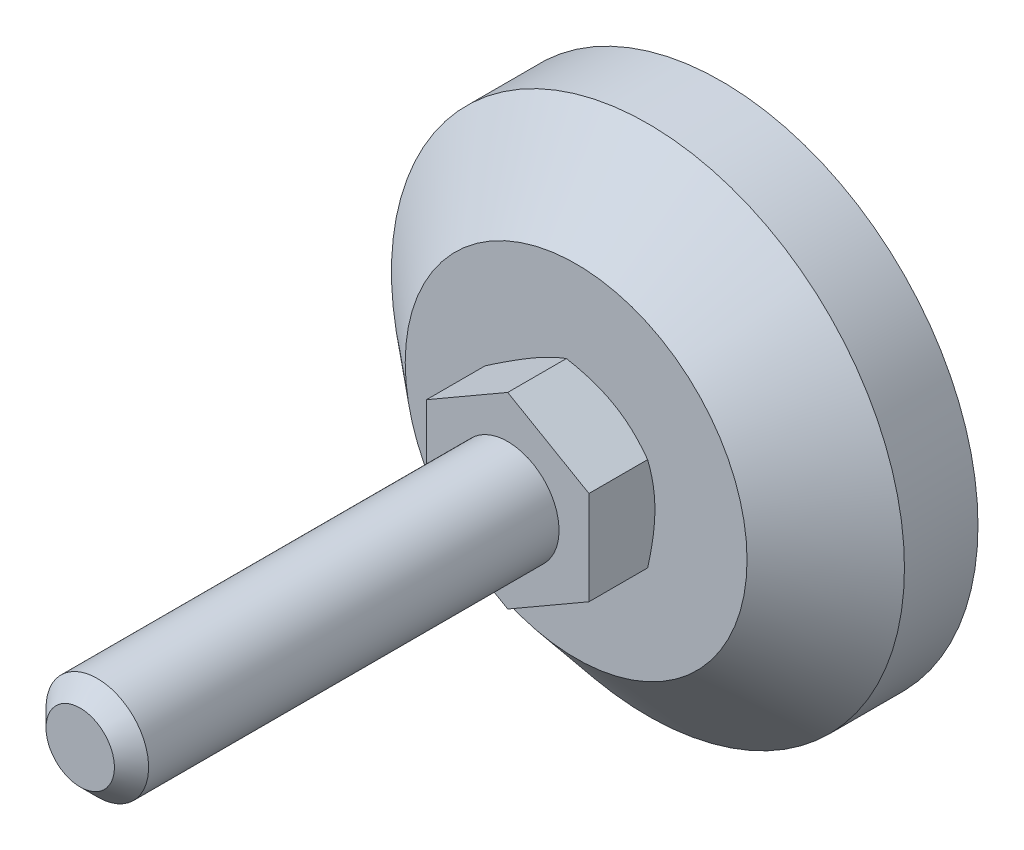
ISO-10303-21;
HEADER;
FILE_DESCRIPTION(('STEP AP214'),'2;1');
FILE_NAME('part.step','',(''),(''),'','','');
FILE_SCHEMA(('AUTOMOTIVE_DESIGN { 1 0 10303 214 1 1 1 1 }'));
ENDSEC;
DATA;
#1=APPLICATION_CONTEXT('core data for automotive mechanical design processes');
#2=APPLICATION_PROTOCOL_DEFINITION('international standard','automotive_design',2000,#1);
#3=PRODUCT_CONTEXT('',#1,'mechanical');
#4=PRODUCT('Part','Part','',(#3));
#5=PRODUCT_RELATED_PRODUCT_CATEGORY('part','',(#4));
#6=PRODUCT_DEFINITION_FORMATION('','',#4);
#7=PRODUCT_DEFINITION_CONTEXT('part definition',#1,'design');
#8=PRODUCT_DEFINITION('design','',#6,#7);
#9=PRODUCT_DEFINITION_SHAPE('','',#8);
#10=(LENGTH_UNIT() NAMED_UNIT(*) SI_UNIT(.MILLI.,.METRE.));
#11=(NAMED_UNIT(*) PLANE_ANGLE_UNIT() SI_UNIT($,.RADIAN.));
#12=(NAMED_UNIT(*) SI_UNIT($,.STERADIAN.) SOLID_ANGLE_UNIT());
#13=UNCERTAINTY_MEASURE_WITH_UNIT(LENGTH_MEASURE(1.E-05),#10,'distance_accuracy_value','');
#14=(GEOMETRIC_REPRESENTATION_CONTEXT(3) GLOBAL_UNCERTAINTY_ASSIGNED_CONTEXT((#13)) GLOBAL_UNIT_ASSIGNED_CONTEXT((#10,
#11,#12)) REPRESENTATION_CONTEXT('',''));
#15=CARTESIAN_POINT('',(0.,0.,0.));
#16=DIRECTION('',(0.,0.,1.));
#17=DIRECTION('',(1.,0.,0.));
#18=AXIS2_PLACEMENT_3D('',#15,#16,#17);
#19=CARTESIAN_POINT('',(0.,0.,25.));
#20=DIRECTION('',(0.,0.,1.));
#21=DIRECTION('',(0.5,-0.866025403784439,0.));
#22=AXIS2_PLACEMENT_3D('',#19,#20,#21);
#23=PLANE('',#22);
#24=DIRECTION('',(0.,1.,0.));
#25=VECTOR('',#24,1.);
#26=CARTESIAN_POINT('',(9.5,-5.48482755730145,25.));
#27=LINE('',#26,#25);
#28=CARTESIAN_POINT('',(9.5,-5.48482755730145,25.));
#29=VERTEX_POINT('',#28);
#30=CARTESIAN_POINT('',(9.5,5.48482755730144,25.));
#31=VERTEX_POINT('',#30);
#32=EDGE_CURVE('E197',#29,#31,#27,.T.);
#33=ORIENTED_EDGE('',*,*,#32,.T.);
#34=DIRECTION('',(-0.866025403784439,0.5,0.));
#35=VECTOR('',#34,1.);
#36=CARTESIAN_POINT('',(9.5,5.48482755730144,25.));
#37=LINE('',#36,#35);
#38=CARTESIAN_POINT('',(0.,10.9696551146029,25.));
#39=VERTEX_POINT('',#38);
#40=EDGE_CURVE('E320',#31,#39,#37,.T.);
#41=ORIENTED_EDGE('',*,*,#40,.T.);
#42=DIRECTION('',(-0.866025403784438,-0.5,0.));
#43=VECTOR('',#42,1.);
#44=CARTESIAN_POINT('',(0.,10.9696551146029,25.));
#45=LINE('',#44,#43);
#46=CARTESIAN_POINT('',(-9.5,5.48482755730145,25.));
#47=VERTEX_POINT('',#46);
#48=EDGE_CURVE('E319',#39,#47,#45,.T.);
#49=ORIENTED_EDGE('',*,*,#48,.T.);
#50=DIRECTION('',(0.,-1.,0.));
#51=VECTOR('',#50,1.);
#52=CARTESIAN_POINT('',(-9.5,5.48482755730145,25.));
#53=LINE('',#52,#51);
#54=CARTESIAN_POINT('',(-9.5,-5.48482755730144,25.));
#55=VERTEX_POINT('',#54);
#56=EDGE_CURVE('E324',#47,#55,#53,.T.);
#57=ORIENTED_EDGE('',*,*,#56,.T.);
#58=DIRECTION('',(0.866025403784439,-0.5,0.));
#59=VECTOR('',#58,1.);
#60=CARTESIAN_POINT('',(-9.5,-5.48482755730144,25.));
#61=LINE('',#60,#59);
#62=CARTESIAN_POINT('',(0.,-10.9696551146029,25.));
#63=VERTEX_POINT('',#62);
#64=EDGE_CURVE('E326',#55,#63,#61,.T.);
#65=ORIENTED_EDGE('',*,*,#64,.T.);
#66=DIRECTION('',(0.866025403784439,0.5,0.));
#67=VECTOR('',#66,1.);
#68=CARTESIAN_POINT('',(0.,-10.9696551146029,25.));
#69=LINE('',#68,#67);
#70=EDGE_CURVE('E37',#63,#29,#69,.T.);
#71=ORIENTED_EDGE('',*,*,#70,.T.);
#72=EDGE_LOOP('',(#33,#41,#49,#57,#65,#71));
#73=FACE_BOUND('',#72,.T.);
#74=CARTESIAN_POINT('',(0.,0.,25.));
#75=DIRECTION('',(0.,0.,1.));
#76=DIRECTION('',(0.5,-0.866025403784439,0.));
#77=AXIS2_PLACEMENT_3D('',#74,#75,#76);
#78=CIRCLE('',#77,6.);
#79=CARTESIAN_POINT('',(3.,-5.19615242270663,25.));
#80=VERTEX_POINT('',#79);
#81=EDGE_CURVE('E201',#80,#80,#78,.T.);
#82=ORIENTED_EDGE('',*,*,#81,.F.);
#83=EDGE_LOOP('',(#82));
#84=FACE_BOUND('',#83,.T.);
#85=ADVANCED_FACE('F14',(#73,#84),#23,.T.);
#86=CARTESIAN_POINT('',(-9.99463491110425,17.3112154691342,17.));
#87=DIRECTION('',(0.,0.,1.));
#88=DIRECTION('',(0.5,-0.866025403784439,0.));
#89=AXIS2_PLACEMENT_3D('',#86,#87,#88);
#90=PLANE('',#89);
#91=CARTESIAN_POINT('',(0.,0.,17.));
#92=DIRECTION('',(0.,0.,-1.));
#93=DIRECTION('',(-0.5,0.866025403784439,0.));
#94=AXIS2_PLACEMENT_3D('',#91,#92,#93);
#95=CIRCLE('',#94,19.9892698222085);
#96=CARTESIAN_POINT('',(-9.99463491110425,17.3112154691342,17.));
#97=VERTEX_POINT('',#96);
#98=EDGE_CURVE('E102',#97,#97,#95,.T.);
#99=ORIENTED_EDGE('',*,*,#98,.F.);
#100=EDGE_LOOP('',(#99));
#101=FACE_BOUND('',#100,.T.);
#102=CARTESIAN_POINT('',(0.,0.,17.));
#103=DIRECTION('',(0.,0.,-1.));
#104=DIRECTION('',(-0.5,0.866025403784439,0.));
#105=AXIS2_PLACEMENT_3D('',#102,#103,#104);
#106=CIRCLE('',#105,9.);
#107=CARTESIAN_POINT('',(-4.5,7.79422863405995,17.));
#108=VERTEX_POINT('',#107);
#109=EDGE_CURVE('E84',#108,#108,#106,.T.);
#110=ORIENTED_EDGE('',*,*,#109,.T.);
#111=EDGE_LOOP('',(#110));
#112=FACE_BOUND('',#111,.T.);
#113=ADVANCED_FACE('F174',(#101,#112),#90,.T.);
#114=CARTESIAN_POINT('',(0.,0.,0.));
#115=DIRECTION('',(0.,0.,-1.));
#116=DIRECTION('',(-0.5,0.866025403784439,0.));
#117=AXIS2_PLACEMENT_3D('',#114,#115,#116);
#118=PLANE('',#117);
#119=CARTESIAN_POINT('',(0.,0.,0.));
#120=DIRECTION('',(0.,0.,-1.));
#121=DIRECTION('',(-0.5,0.866025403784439,0.));
#122=AXIS2_PLACEMENT_3D('',#119,#120,#121);
#123=CIRCLE('',#122,30.);
#124=CARTESIAN_POINT('',(-15.,25.9807621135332,0.));
#125=VERTEX_POINT('',#124);
#126=EDGE_CURVE('E73',#125,#125,#123,.T.);
#127=ORIENTED_EDGE('',*,*,#126,.T.);
#128=EDGE_LOOP('',(#127));
#129=FACE_BOUND('',#128,.T.);
#130=ADVANCED_FACE('F177',(#129),#118,.T.);
#131=CARTESIAN_POINT('',(0.,0.,-75.4972525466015));
#132=DIRECTION('',(0.,0.,-1.));
#133=DIRECTION('',(-0.5,0.866025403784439,0.));
#134=AXIS2_PLACEMENT_3D('',#131,#132,#133);
#135=CYLINDRICAL_SURFACE('',#134,30.);
#136=CARTESIAN_POINT('',(0.,0.,8.6));
#137=DIRECTION('',(0.,0.,-1.));
#138=DIRECTION('',(-0.5,0.866025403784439,0.));
#139=AXIS2_PLACEMENT_3D('',#136,#137,#138);
#140=CIRCLE('',#139,30.);
#141=CARTESIAN_POINT('',(-15.,25.9807621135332,8.6));
#142=VERTEX_POINT('',#141);
#143=EDGE_CURVE('E105',#142,#142,#140,.T.);
#144=ORIENTED_EDGE('',*,*,#143,.T.);
#145=EDGE_LOOP('',(#144));
#146=FACE_BOUND('',#145,.T.);
#147=ORIENTED_EDGE('',*,*,#126,.F.);
#148=EDGE_LOOP('',(#147));
#149=FACE_BOUND('',#148,.T.);
#150=ADVANCED_FACE('F181',(#146,#149),#135,.T.);
#151=CARTESIAN_POINT('',(0.,0.,8.6));
#152=DIRECTION('',(0.,0.,-1.));
#153=DIRECTION('',(-0.5,0.866025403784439,0.));
#154=AXIS2_PLACEMENT_3D('',#151,#152,#153);
#155=CONICAL_SURFACE('',#154,30.,0.872664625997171);
#156=ORIENTED_EDGE('',*,*,#98,.T.);
#157=EDGE_LOOP('',(#156));
#158=FACE_BOUND('',#157,.T.);
#159=ORIENTED_EDGE('',*,*,#143,.F.);
#160=EDGE_LOOP('',(#159));
#161=FACE_BOUND('',#160,.T.);
#162=ADVANCED_FACE('F121',(#158,#161),#155,.T.);
#163=CARTESIAN_POINT('',(0.,0.,20.2070856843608));
#164=DIRECTION('',(0.,0.,1.));
#165=DIRECTION('',(0.5,-0.866025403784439,0.));
#166=AXIS2_PLACEMENT_3D('',#163,#164,#165);
#167=CONICAL_SURFACE('',#166,14.5548353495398,1.0471975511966);
#168=ORIENTED_EDGE('',*,*,#109,.F.);
#169=EDGE_LOOP('',(#168));
#170=FACE_BOUND('',#169,.T.);
#171=CARTESIAN_POINT('',(-8.0629212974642,-15.6247848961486,21.955113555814));
#172=CARTESIAN_POINT('',(-7.88302842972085,-15.5209237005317,21.8541996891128));
#173=CARTESIAN_POINT('',(-7.70292590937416,-15.4169414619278,21.7537843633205));
#174=CARTESIAN_POINT('',(-7.34225784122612,-15.2087096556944,21.5540635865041));
#175=CARTESIAN_POINT('',(-7.16169228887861,-15.1044600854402,21.4547581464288));
#176=CARTESIAN_POINT('',(-6.61918813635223,-14.7912451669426,21.158650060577));
#177=CARTESIAN_POINT('',(-6.25649443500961,-14.5818438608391,20.9636851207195));
#178=CARTESIAN_POINT('',(-5.52674967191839,-14.1605255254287,20.5787866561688));
#179=CARTESIAN_POINT('',(-5.15968567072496,-13.9486010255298,20.3888857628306));
#180=CARTESIAN_POINT('',(-4.42265753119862,-13.5230776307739,20.016769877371));
#181=CARTESIAN_POINT('',(-4.05269352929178,-13.3094788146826,19.834554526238));
#182=CARTESIAN_POINT('',(-3.29714002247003,-12.8732597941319,19.4740509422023));
#183=CARTESIAN_POINT('',(-2.911434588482,-12.650572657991,19.2960849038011));
#184=CARTESIAN_POINT('',(-2.1355321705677,-12.2026051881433,18.953471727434));
#185=CARTESIAN_POINT('',(-1.74533469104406,-11.9773245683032,18.7888260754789));
#186=CARTESIAN_POINT('',(-0.960535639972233,-11.5242206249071,18.4771310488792));
#187=CARTESIAN_POINT('',(-0.565944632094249,-11.2964034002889,18.3300465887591));
#188=CARTESIAN_POINT('',(0.228883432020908,-10.8375092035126,18.0581506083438));
#189=CARTESIAN_POINT('',(0.62911868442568,-10.6064332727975,17.9333321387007));
#190=CARTESIAN_POINT('',(1.43330236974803,-10.1421376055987,17.7125905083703));
#191=CARTESIAN_POINT('',(1.83721725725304,-9.90893723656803,17.6165087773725));
#192=CARTESIAN_POINT('',(2.44681047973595,-9.55698842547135,17.4980679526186));
#193=CARTESIAN_POINT('',(2.65064289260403,-9.4393057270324,17.4628663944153));
#194=CARTESIAN_POINT('',(3.05933909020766,-9.20334486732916,17.4017128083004));
#195=CARTESIAN_POINT('',(3.26420277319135,-9.08506676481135,17.3757598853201));
#196=CARTESIAN_POINT('',(3.67198665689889,-8.84963262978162,17.3339494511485));
#197=CARTESIAN_POINT('',(3.87489694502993,-8.73248232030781,17.3179635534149));
#198=CARTESIAN_POINT('',(4.28112129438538,-8.49794858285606,17.2959174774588));
#199=CARTESIAN_POINT('',(4.48443534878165,-8.38056515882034,17.2898571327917));
#200=CARTESIAN_POINT('',(4.89110353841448,-8.14577517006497,17.2878069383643));
#201=CARTESIAN_POINT('',(5.09445767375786,-8.02836860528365,17.2918171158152));
#202=CARTESIAN_POINT('',(5.50083733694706,-7.79374519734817,17.3098091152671));
#203=CARTESIAN_POINT('',(5.70386284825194,-7.67652836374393,17.3237914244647));
#204=CARTESIAN_POINT('',(6.19015483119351,-7.39576755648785,17.3689276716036));
#205=CARTESIAN_POINT('',(6.47310620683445,-7.23240550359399,17.4047077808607));
#206=CARTESIAN_POINT('',(7.03693098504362,-6.90688111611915,17.4936993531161));
#207=CARTESIAN_POINT('',(7.31780410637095,-6.74471894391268,17.546913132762));
#208=CARTESIAN_POINT('',(8.15697152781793,-6.2602254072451,17.729885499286));
#209=CARTESIAN_POINT('',(8.71150741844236,-5.94006396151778,17.8829428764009));
#210=CARTESIAN_POINT('',(9.54078576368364,-5.4612798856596,18.148698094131));
#211=CARTESIAN_POINT('',(9.819821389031,-5.30017859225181,18.2445639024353));
#212=CARTESIAN_POINT('',(10.375183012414,-4.97954040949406,18.4463370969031));
#213=CARTESIAN_POINT('',(10.6515089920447,-4.82000353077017,18.552244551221));
#214=CARTESIAN_POINT('',(11.201537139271,-4.50244463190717,18.7723946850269));
#215=CARTESIAN_POINT('',(11.4752401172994,-4.34442214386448,18.8866346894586));
#216=CARTESIAN_POINT('',(12.0203730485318,-4.02968949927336,19.1220972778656));
#217=CARTESIAN_POINT('',(12.2918030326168,-3.87297932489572,19.2433197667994));
#218=CARTESIAN_POINT('',(12.9489666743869,-3.4935657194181,19.544986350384));
#219=CARTESIAN_POINT('',(13.3336498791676,-3.27146876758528,19.7284765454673));
#220=CARTESIAN_POINT('',(14.0996081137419,-2.82924257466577,20.104736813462));
#221=CARTESIAN_POINT('',(14.4808829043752,-2.60911347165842,20.2975075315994));
#222=CARTESIAN_POINT('',(15.2406869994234,-2.170440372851,20.6904048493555));
#223=CARTESIAN_POINT('',(15.619215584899,-1.95189679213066,20.8905332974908));
#224=CARTESIAN_POINT('',(16.3739075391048,-1.51617518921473,21.2966079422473));
#225=CARTESIAN_POINT('',(16.7500709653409,-1.29899713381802,21.5025539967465));
#226=CARTESIAN_POINT('',(17.5008876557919,-0.865512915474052,21.9193891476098));
#227=CARTESIAN_POINT('',(17.8755385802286,-0.649208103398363,22.1302838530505));
#228=CARTESIAN_POINT('',(18.6232021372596,-0.217544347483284,22.5559100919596));
#229=CARTESIAN_POINT('',(18.9962147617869,-0.00218540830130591,22.7706416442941));
#230=CARTESIAN_POINT('',(19.7408074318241,0.42770537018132,23.203233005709));
#231=CARTESIAN_POINT('',(20.112387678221,0.642237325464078,23.4210923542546));
#232=CARTESIAN_POINT('',(20.8543824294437,1.07062819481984,23.8594435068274));
#233=CARTESIAN_POINT('',(21.2247969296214,1.28448710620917,24.0799353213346));
#234=CARTESIAN_POINT('',(22.2694002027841,1.88758908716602,24.7056802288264));
#235=CARTESIAN_POINT('',(22.9424390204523,2.2761682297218,25.1134927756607));
#236=CARTESIAN_POINT('',(24.2860532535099,3.05190426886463,25.9345548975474));
#237=CARTESIAN_POINT('',(24.9566285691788,3.439061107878,26.3478046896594));
#238=CARTESIAN_POINT('',(26.2940646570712,4.21123019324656,27.1773352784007));
#239=CARTESIAN_POINT('',(26.9609305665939,4.59624540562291,27.5936050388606));
#240=CARTESIAN_POINT('',(27.9600759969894,5.17310228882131,28.2204041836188));
#241=CARTESIAN_POINT('',(28.2929225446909,5.3652713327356,28.4297301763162));
#242=CARTESIAN_POINT('',(28.958275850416,5.74941324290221,28.8490996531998));
#243=CARTESIAN_POINT('',(29.2907826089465,5.94138610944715,29.0591431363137));
#244=CARTESIAN_POINT('',(29.6231390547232,6.13327219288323,29.269503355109));
#245=B_SPLINE_CURVE_WITH_KNOTS('',3,(#171,#172,#173,#174,#175,#176,#177,#178,#179,#180,#181,
#182,#183,#184,#185,#186,#187,#188,#189,#190,#191,#192,#193,#194,#195,#196,#197,#198,#199,#200,
#201,#202,#203,#204,#205,#206,#207,#208,#209,#210,#211,#212,#213,#214,#215,#216,#217,#218,#219,
#220,#221,#222,#223,#224,#225,#226,#227,#228,#229,#230,#231,#232,#233,#234,#235,#236,#237,#238,
#239,#240,#241,#242,#243,#244),.UNSPECIFIED.,.F.,.F.,(4,2,2,2,2,2,2,2,2,2,2,2,2,2,2,2,2,2,2,2,2,
2,2,2,2,2,2,2,2,2,2,2,2,2,2,2,4),(0.,0.692811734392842,1.38563029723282,2.7714693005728,
4.16474840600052,5.55796235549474,6.99664082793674,8.43547957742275,9.87139378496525,
11.3068590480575,12.734250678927,13.4480473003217,14.1617748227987,14.8661077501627,
15.5704288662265,16.2747518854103,16.9791093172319,17.9645860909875,18.9501938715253,
20.9224706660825,21.9308705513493,22.9392772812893,23.9473616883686,24.9554323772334,
26.397088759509,27.838845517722,29.2809670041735,30.7230532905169,32.1668616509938,
33.6106771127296,35.0542821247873,36.4978928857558,39.1308383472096,41.7638892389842,
44.3899112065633,45.7028456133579,47.0157780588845),.UNSPECIFIED.);
#246=CARTESIAN_POINT('',(0.,-10.9696551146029,18.1371809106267));
#247=VERTEX_POINT('',#246);
#248=CARTESIAN_POINT('',(9.5,-5.48482755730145,18.1371809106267));
#249=VERTEX_POINT('',#248);
#250=EDGE_CURVE('E65',#247,#249,#245,.T.);
#251=ORIENTED_EDGE('',*,*,#250,.F.);
#252=CARTESIAN_POINT('',(-9.5002,-5.4847120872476,18.137247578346));
#253=CARTESIAN_POINT('',(-9.29136922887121,-5.60528058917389,18.0676485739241));
#254=CARTESIAN_POINT('',(-9.0817598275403,-5.72629863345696,18.0012084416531));
#255=CARTESIAN_POINT('',(-8.66086011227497,-5.96930519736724,17.8755224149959));
#256=CARTESIAN_POINT('',(-8.44956926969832,-6.09129402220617,17.8162788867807));
#257=CARTESIAN_POINT('',(-7.81229220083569,-6.45922610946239,17.6504897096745));
#258=CARTESIAN_POINT('',(-7.38379023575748,-6.70662183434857,17.5561895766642));
#259=CARTESIAN_POINT('',(-6.74255666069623,-7.07683821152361,17.4456138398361));
#260=CARTESIAN_POINT('',(-6.53174078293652,-7.19855281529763,17.4141149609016));
#261=CARTESIAN_POINT('',(-6.10913296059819,-7.4425455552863,17.3612933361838));
#262=CARTESIAN_POINT('',(-5.89734099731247,-7.56482370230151,17.3399707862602));
#263=CARTESIAN_POINT('',(-5.47340378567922,-7.80958396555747,17.3080481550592));
#264=CARTESIAN_POINT('',(-5.26125925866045,-7.93206566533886,17.2974353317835));
#265=CARTESIAN_POINT('',(-4.83677424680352,-8.17714220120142,17.2871576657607));
#266=CARTESIAN_POINT('',(-4.62443376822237,-8.29973703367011,17.2874924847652));
#267=CARTESIAN_POINT('',(-4.22745800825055,-8.5289310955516,17.2983485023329));
#268=CARTESIAN_POINT('',(-4.04279470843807,-8.63554650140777,17.3075454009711));
#269=CARTESIAN_POINT('',(-3.67389999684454,-8.84852796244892,17.3340405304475));
#270=CARTESIAN_POINT('',(-3.48966861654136,-8.95489399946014,17.3513393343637));
#271=CARTESIAN_POINT('',(-2.937688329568,-9.27357996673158,17.414979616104));
#272=CARTESIAN_POINT('',(-2.57091646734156,-9.48533580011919,17.4730570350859));
#273=CARTESIAN_POINT('',(-1.83348217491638,-9.91109368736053,17.618251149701));
#274=CARTESIAN_POINT('',(-1.46291385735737,-10.1250414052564,17.7059833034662));
#275=CARTESIAN_POINT('',(-0.727303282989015,-10.5497463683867,17.9050988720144));
#276=CARTESIAN_POINT('',(-0.362251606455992,-10.7605090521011,18.0164355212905));
#277=CARTESIAN_POINT('',(0.000200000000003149,-10.9697705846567,18.137247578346));
#278=B_SPLINE_CURVE_WITH_KNOTS('',3,(#252,#253,#254,#255,#256,#257,#258,#259,#260,#261,#262,
#263,#264,#265,#266,#267,#268,#269,#270,#271,#272,#273,#274,#275,#276,#277),.UNSPECIFIED.,.F.,
.F.,(4,2,2,2,2,2,2,2,2,2,2,2,4),(0.,0.752880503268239,1.50600787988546,3.0154687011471,
3.75167336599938,4.48789219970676,5.22323407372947,5.95855322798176,6.59868084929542,
7.23885375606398,8.52010929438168,9.82978009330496,11.1368800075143),.UNSPECIFIED.);
#279=CARTESIAN_POINT('',(-9.5,-5.48482755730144,18.1371809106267));
#280=VERTEX_POINT('',#279);
#281=EDGE_CURVE('E68',#280,#247,#278,.T.);
#282=ORIENTED_EDGE('',*,*,#281,.F.);
#283=CARTESIAN_POINT('',(-9.5,5.48505849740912,18.137247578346));
#284=CARTESIAN_POINT('',(-9.5,5.24392149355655,18.0676485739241));
#285=CARTESIAN_POINT('',(-9.5,5.0018854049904,18.0012084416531));
#286=CARTESIAN_POINT('',(-9.5,4.51587227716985,17.8755224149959));
#287=CARTESIAN_POINT('',(-9.5,4.27189462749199,17.8162788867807));
#288=CARTESIAN_POINT('',(-9.5,3.53603045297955,17.6504897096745));
#289=CARTESIAN_POINT('',(-9.5,3.04123900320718,17.5561895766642));
#290=CARTESIAN_POINT('',(-9.5,2.3008062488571,17.4456138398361));
#291=CARTESIAN_POINT('',(-9.5,2.05737704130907,17.4141149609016));
#292=CARTESIAN_POINT('',(-9.5,1.56939156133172,17.3612933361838));
#293=CARTESIAN_POINT('',(-9.5,1.32483526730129,17.3399707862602));
#294=CARTESIAN_POINT('',(-9.5,0.835314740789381,17.3080481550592));
#295=CARTESIAN_POINT('',(-9.5,0.590351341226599,17.2974353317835));
#296=CARTESIAN_POINT('',(-9.5,0.100198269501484,17.2871576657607));
#297=CARTESIAN_POINT('',(-9.5,-0.144991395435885,17.2874924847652));
#298=CARTESIAN_POINT('',(-9.5,-0.603379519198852,17.2983485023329));
#299=CARTESIAN_POINT('',(-9.5,-0.816610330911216,17.3075454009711));
#300=CARTESIAN_POINT('',(-9.5,-1.24257325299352,17.3340405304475));
#301=CARTESIAN_POINT('',(-9.5,-1.45530532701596,17.3513393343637));
#302=CARTESIAN_POINT('',(-9.5,-2.09267726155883,17.414979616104));
#303=CARTESIAN_POINT('',(-9.5,-2.51618892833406,17.4730570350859));
#304=CARTESIAN_POINT('',(-9.5,-3.36770470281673,17.618251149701));
#305=CARTESIAN_POINT('',(-9.5,-3.79560013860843,17.7059833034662));
#306=CARTESIAN_POINT('',(-9.5,-4.64501006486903,17.9050988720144));
#307=CARTESIAN_POINT('',(-9.5,-5.06653543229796,18.0164355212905));
#308=CARTESIAN_POINT('',(-9.5,-5.48505849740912,18.137247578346));
#309=B_SPLINE_CURVE_WITH_KNOTS('',3,(#283,#284,#285,#286,#287,#288,#289,#290,#291,#292,#293,
#294,#295,#296,#297,#298,#299,#300,#301,#302,#303,#304,#305,#306,#307,#308),.UNSPECIFIED.,.F.,
.F.,(4,2,2,2,2,2,2,2,2,2,2,2,4),(0.,0.752880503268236,1.50600787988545,3.0154687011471,
3.75167336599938,4.48789219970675,5.22323407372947,5.95855322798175,6.59868084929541,
7.23885375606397,8.52010929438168,9.82978009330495,11.1368800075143),.UNSPECIFIED.);
#310=CARTESIAN_POINT('',(-9.5,5.48482755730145,18.1371809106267));
#311=VERTEX_POINT('',#310);
#312=EDGE_CURVE('E83',#311,#280,#309,.T.);
#313=ORIENTED_EDGE('',*,*,#312,.F.);
#314=CARTESIAN_POINT('',(-17.5629212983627,0.829697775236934,21.9551135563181));
#315=CARTESIAN_POINT('',(-17.3830284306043,0.933558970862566,21.8541996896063));
#316=CARTESIAN_POINT('',(-17.2029259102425,1.03754120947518,21.7537843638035));
#317=CARTESIAN_POINT('',(-16.8422578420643,1.245773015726,21.5540635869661));
#318=CARTESIAN_POINT('',(-16.6616922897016,1.35002258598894,21.4547581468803));
#319=CARTESIAN_POINT('',(-16.1191881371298,1.66323750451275,21.1586500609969));
#320=CARTESIAN_POINT('',(-15.7564944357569,1.8726388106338,20.9636851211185));
#321=CARTESIAN_POINT('',(-15.0267496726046,2.29395714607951,20.5787866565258));
#322=CARTESIAN_POINT('',(-14.6596856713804,2.50588164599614,20.3888857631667));
#323=CARTESIAN_POINT('',(-13.9226575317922,2.93140504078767,20.0167698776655));
#324=CARTESIAN_POINT('',(-13.5526935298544,3.14500385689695,19.8345545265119));
#325=CARTESIAN_POINT('',(-12.7971400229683,3.58122287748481,19.4740509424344));
#326=CARTESIAN_POINT('',(-12.4114345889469,3.80391001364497,19.296084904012));
#327=CARTESIAN_POINT('',(-11.6355321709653,4.25187748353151,18.9534717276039));
#328=CARTESIAN_POINT('',(-11.2453346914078,4.47715810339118,18.7888260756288));
#329=CARTESIAN_POINT('',(-10.4605356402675,4.93026204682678,18.477131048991));
#330=CARTESIAN_POINT('',(-10.065944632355,5.15807927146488,18.3300465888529));
#331=CARTESIAN_POINT('',(-9.27111656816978,5.61697346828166,18.0581506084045));
#332=CARTESIAN_POINT('',(-8.87088131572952,5.84804939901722,17.9333321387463));
#333=CARTESIAN_POINT('',(-8.06669763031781,6.31234506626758,17.7125905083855));
#334=CARTESIAN_POINT('',(-7.66278274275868,6.54554543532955,17.6165087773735));
#335=CARTESIAN_POINT('',(-7.05318952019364,6.89749424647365,17.4980679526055));
#336=CARTESIAN_POINT('',(-6.84935710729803,7.0151769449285,17.4628663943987));
#337=CARTESIAN_POINT('',(-6.44066090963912,7.25113780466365,17.4017128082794));
#338=CARTESIAN_POINT('',(-6.23579722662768,7.36941590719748,17.3757598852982));
#339=CARTESIAN_POINT('',(-5.82801334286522,7.60485004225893,17.3339494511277));
#340=CARTESIAN_POINT('',(-5.62510305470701,7.72200035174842,17.3179635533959));
#341=CARTESIAN_POINT('',(-5.21887870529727,7.95653408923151,17.2959174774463));
#342=CARTESIAN_POINT('',(-5.01556465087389,8.07391751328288,17.2898571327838));
#343=CARTESIAN_POINT('',(-4.60889646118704,8.30870750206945,17.2878069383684));
#344=CARTESIAN_POINT('',(-4.40554232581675,8.42611406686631,17.2918171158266));
#345=CARTESIAN_POINT('',(-3.9991626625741,8.66073747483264,17.3098091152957));
#346=CARTESIAN_POINT('',(-3.79613715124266,8.7779543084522,17.3237914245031));
#347=CARTESIAN_POINT('',(-3.30984516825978,9.05871511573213,17.3689276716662));
#348=CARTESIAN_POINT('',(-3.0268937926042,9.22207716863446,17.4047077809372));
#349=CARTESIAN_POINT('',(-2.46306901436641,9.54760155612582,17.4936993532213));
#350=CARTESIAN_POINT('',(-2.18219589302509,9.70976372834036,17.5469131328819));
#351=CARTESIAN_POINT('',(-1.34302847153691,10.1942572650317,17.7298854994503));
#352=CARTESIAN_POINT('',(-0.788492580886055,10.5144187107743,17.8829428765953));
#353=CARTESIAN_POINT('',(0.0407857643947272,10.9932027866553,18.1486980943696));
#354=CARTESIAN_POINT('',(0.319821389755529,11.1543040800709,18.2445639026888));
#355=CARTESIAN_POINT('',(0.875183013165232,11.474942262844,18.4463370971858));
#356=CARTESIAN_POINT('',(1.15150899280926,11.6344791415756,18.5522445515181));
#357=CARTESIAN_POINT('',(1.70153714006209,11.9520380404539,18.7723946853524));
#358=CARTESIAN_POINT('',(1.97524011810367,12.1100605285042,18.886634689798));
#359=CARTESIAN_POINT('',(2.52037304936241,12.4247931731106,19.1220972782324));
#360=CARTESIAN_POINT('',(2.79180303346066,12.5815033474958,19.2433197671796));
#361=CARTESIAN_POINT('',(3.44896667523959,12.9609169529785,19.5449863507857));
#362=CARTESIAN_POINT('',(3.8336498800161,13.183013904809,19.728476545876));
#363=CARTESIAN_POINT('',(4.5996081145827,13.625240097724,20.1047368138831));
#364=CARTESIAN_POINT('',(4.98088290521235,13.8453692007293,20.2975075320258));
#365=CARTESIAN_POINT('',(5.74068700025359,14.2840422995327,20.6904048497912));
#366=CARTESIAN_POINT('',(6.11921558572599,14.5025858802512,20.8905332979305));
#367=CARTESIAN_POINT('',(6.87390753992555,14.9383074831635,21.2966079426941));
#368=CARTESIAN_POINT('',(7.25007096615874,15.1554855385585,21.5025539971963));
#369=CARTESIAN_POINT('',(8.00088765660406,15.5889697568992,21.9193891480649));
#370=CARTESIAN_POINT('',(8.37553858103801,15.8052745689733,22.1302838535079));
#371=CARTESIAN_POINT('',(9.12320213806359,16.2369383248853,22.5559100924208));
#372=CARTESIAN_POINT('',(9.49621476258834,16.4522972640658,22.7706416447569));
#373=CARTESIAN_POINT('',(10.2408074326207,16.8821880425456,23.2032330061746));
#374=CARTESIAN_POINT('',(10.6123876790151,17.0967199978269,23.4210923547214));
#375=CARTESIAN_POINT('',(11.3543824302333,17.5251108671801,23.8594435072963));
#376=CARTESIAN_POINT('',(11.7247969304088,17.7389697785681,24.0799353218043));
#377=CARTESIAN_POINT('',(12.7694002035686,18.3420717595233,24.7056802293));
#378=CARTESIAN_POINT('',(13.4424390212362,18.7306509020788,25.113492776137));
#379=CARTESIAN_POINT('',(14.786053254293,19.5063869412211,25.9345548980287));
#380=CARTESIAN_POINT('',(15.4566285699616,19.8935437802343,26.3478046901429));
#381=CARTESIAN_POINT('',(16.7940646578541,20.665712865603,27.1773352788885));
#382=CARTESIAN_POINT('',(17.4609305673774,21.0507280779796,27.5936050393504));
#383=CARTESIAN_POINT('',(18.4600759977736,21.6275849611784,28.2204041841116));
#384=CARTESIAN_POINT('',(18.7929225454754,21.8197540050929,28.42973017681));
#385=CARTESIAN_POINT('',(19.4582758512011,22.2038959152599,28.8490996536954));
#386=CARTESIAN_POINT('',(19.7907826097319,22.395868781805,29.0591431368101));
#387=CARTESIAN_POINT('',(20.1231390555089,22.5877548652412,29.2695033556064));
#388=B_SPLINE_CURVE_WITH_KNOTS('',3,(#314,#315,#316,#317,#318,#319,#320,#321,#322,#323,#324,
#325,#326,#327,#328,#329,#330,#331,#332,#333,#334,#335,#336,#337,#338,#339,#340,#341,#342,#343,
#344,#345,#346,#347,#348,#349,#350,#351,#352,#353,#354,#355,#356,#357,#358,#359,#360,#361,#362,
#363,#364,#365,#366,#367,#368,#369,#370,#371,#372,#373,#374,#375,#376,#377,#378,#379,#380,#381,
#382,#383,#384,#385,#386,#387),.UNSPECIFIED.,.F.,.F.,(4,2,2,2,2,2,2,2,2,2,2,2,2,2,2,2,2,2,2,2,2,
2,2,2,2,2,2,2,2,2,2,2,2,2,2,2,4),(0.,0.692811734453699,1.38563029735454,2.77146930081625,
4.16474840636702,5.55796235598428,6.99664082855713,8.43547957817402,9.87139378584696,
11.3068590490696,12.7342506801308,13.4480473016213,14.1617748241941,14.8661077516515,
15.5704288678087,16.2747518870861,16.9791093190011,17.9645860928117,18.9501938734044,
20.9224706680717,21.9308705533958,22.9392772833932,23.9473616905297,24.9554323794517,
26.3970887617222,27.8388455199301,29.2809670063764,30.7230532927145,32.1668616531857,
33.6106771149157,35.0542821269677,36.4978928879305,39.1308383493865,41.7638892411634,
44.3899112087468,45.7028456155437,47.0157780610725),.UNSPECIFIED.);
#389=CARTESIAN_POINT('',(0.,10.9696551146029,18.1371809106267));
#390=VERTEX_POINT('',#389);
#391=EDGE_CURVE('E143',#390,#311,#388,.F.);
#392=ORIENTED_EDGE('',*,*,#391,.F.);
#393=CARTESIAN_POINT('',(9.5002,5.4847120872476,18.137247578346));
#394=CARTESIAN_POINT('',(9.29136922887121,5.60528058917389,18.0676485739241));
#395=CARTESIAN_POINT('',(9.0817598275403,5.72629863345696,18.0012084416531));
#396=CARTESIAN_POINT('',(8.66086011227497,5.96930519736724,17.8755224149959));
#397=CARTESIAN_POINT('',(8.44956926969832,6.09129402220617,17.8162788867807));
#398=CARTESIAN_POINT('',(7.81229220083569,6.45922610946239,17.6504897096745));
#399=CARTESIAN_POINT('',(7.38379023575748,6.70662183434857,17.5561895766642));
#400=CARTESIAN_POINT('',(6.74255666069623,7.07683821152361,17.4456138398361));
#401=CARTESIAN_POINT('',(6.53174078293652,7.19855281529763,17.4141149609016));
#402=CARTESIAN_POINT('',(6.10913296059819,7.4425455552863,17.3612933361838));
#403=CARTESIAN_POINT('',(5.89734099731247,7.56482370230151,17.3399707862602));
#404=CARTESIAN_POINT('',(5.47340378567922,7.80958396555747,17.3080481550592));
#405=CARTESIAN_POINT('',(5.26125925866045,7.93206566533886,17.2974353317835));
#406=CARTESIAN_POINT('',(4.83677424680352,8.17714220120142,17.2871576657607));
#407=CARTESIAN_POINT('',(4.62443376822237,8.29973703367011,17.2874924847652));
#408=CARTESIAN_POINT('',(4.22745800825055,8.5289310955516,17.2983485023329));
#409=CARTESIAN_POINT('',(4.04279470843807,8.63554650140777,17.3075454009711));
#410=CARTESIAN_POINT('',(3.67389999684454,8.84852796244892,17.3340405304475));
#411=CARTESIAN_POINT('',(3.48966861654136,8.95489399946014,17.3513393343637));
#412=CARTESIAN_POINT('',(2.937688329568,9.27357996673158,17.414979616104));
#413=CARTESIAN_POINT('',(2.57091646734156,9.48533580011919,17.4730570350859));
#414=CARTESIAN_POINT('',(1.83348217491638,9.91109368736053,17.618251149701));
#415=CARTESIAN_POINT('',(1.46291385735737,10.1250414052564,17.7059833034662));
#416=CARTESIAN_POINT('',(0.727303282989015,10.5497463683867,17.9050988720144));
#417=CARTESIAN_POINT('',(0.362251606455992,10.7605090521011,18.0164355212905));
#418=CARTESIAN_POINT('',(-0.000200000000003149,10.9697705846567,18.137247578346));
#419=B_SPLINE_CURVE_WITH_KNOTS('',3,(#393,#394,#395,#396,#397,#398,#399,#400,#401,#402,#403,
#404,#405,#406,#407,#408,#409,#410,#411,#412,#413,#414,#415,#416,#417,#418),.UNSPECIFIED.,.F.,
.F.,(4,2,2,2,2,2,2,2,2,2,2,2,4),(0.,0.752880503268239,1.50600787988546,3.0154687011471,
3.75167336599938,4.48789219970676,5.22323407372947,5.95855322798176,6.59868084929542,
7.23885375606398,8.52010929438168,9.82978009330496,11.1368800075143),.UNSPECIFIED.);
#420=CARTESIAN_POINT('',(9.5,5.48482755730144,18.1371809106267));
#421=VERTEX_POINT('',#420);
#422=EDGE_CURVE('E150',#421,#390,#419,.T.);
#423=ORIENTED_EDGE('',*,*,#422,.F.);
#424=CARTESIAN_POINT('',(9.5,-5.48505849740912,18.137247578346));
#425=CARTESIAN_POINT('',(9.5,-5.24392149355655,18.0676485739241));
#426=CARTESIAN_POINT('',(9.5,-5.00188540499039,18.0012084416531));
#427=CARTESIAN_POINT('',(9.5,-4.51587227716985,17.8755224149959));
#428=CARTESIAN_POINT('',(9.5,-4.27189462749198,17.8162788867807));
#429=CARTESIAN_POINT('',(9.5,-3.53603045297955,17.6504897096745));
#430=CARTESIAN_POINT('',(9.5,-3.04123900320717,17.5561895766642));
#431=CARTESIAN_POINT('',(9.5,-2.3008062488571,17.4456138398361));
#432=CARTESIAN_POINT('',(9.5,-2.05737704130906,17.4141149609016));
#433=CARTESIAN_POINT('',(9.5,-1.56939156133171,17.3612933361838));
#434=CARTESIAN_POINT('',(9.5,-1.32483526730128,17.3399707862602));
#435=CARTESIAN_POINT('',(9.5,-0.83531474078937,17.3080481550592));
#436=CARTESIAN_POINT('',(9.5,-0.590351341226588,17.2974353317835));
#437=CARTESIAN_POINT('',(9.5,-0.100198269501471,17.2871576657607));
#438=CARTESIAN_POINT('',(9.5,0.144991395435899,17.2874924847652));
#439=CARTESIAN_POINT('',(9.5,0.603379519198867,17.2983485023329));
#440=CARTESIAN_POINT('',(9.5,0.816610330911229,17.3075454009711));
#441=CARTESIAN_POINT('',(9.5,1.24257325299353,17.3340405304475));
#442=CARTESIAN_POINT('',(9.5,1.45530532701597,17.3513393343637));
#443=CARTESIAN_POINT('',(9.5,2.09267726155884,17.414979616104));
#444=CARTESIAN_POINT('',(9.5,2.51618892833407,17.4730570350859));
#445=CARTESIAN_POINT('',(9.5,3.36770470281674,17.618251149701));
#446=CARTESIAN_POINT('',(9.5,3.79560013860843,17.7059833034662));
#447=CARTESIAN_POINT('',(9.5,4.64501006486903,17.9050988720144));
#448=CARTESIAN_POINT('',(9.5,5.06653543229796,18.0164355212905));
#449=CARTESIAN_POINT('',(9.5,5.48505849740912,18.137247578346));
#450=B_SPLINE_CURVE_WITH_KNOTS('',3,(#424,#425,#426,#427,#428,#429,#430,#431,#432,#433,#434,
#435,#436,#437,#438,#439,#440,#441,#442,#443,#444,#445,#446,#447,#448,#449),.UNSPECIFIED.,.F.,
.F.,(4,2,2,2,2,2,2,2,2,2,2,2,4),(0.,0.75288050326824,1.50600787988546,3.01546870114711,
3.75167336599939,4.48789219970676,5.22323407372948,5.95855322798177,6.59868084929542,
7.23885375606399,8.52010929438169,9.82978009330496,11.1368800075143),.UNSPECIFIED.);
#451=EDGE_CURVE('E29',#249,#421,#450,.T.);
#452=ORIENTED_EDGE('',*,*,#451,.F.);
#453=EDGE_LOOP('',(#251,#282,#313,#392,#423,#452));
#454=FACE_BOUND('',#453,.T.);
#455=ADVANCED_FACE('F67',(#170,#454),#167,.T.);
#456=CARTESIAN_POINT('',(0.,-10.9696551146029,25.));
#457=DIRECTION('',(-0.5,0.866025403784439,0.));
#458=DIRECTION('',(0.,0.,1.));
#459=AXIS2_PLACEMENT_3D('',#456,#457,#458);
#460=PLANE('',#459);
#461=DIRECTION('',(0.,0.,-1.));
#462=VECTOR('',#461,1.);
#463=CARTESIAN_POINT('',(0.,-10.9696551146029,25.));
#464=LINE('',#463,#462);
#465=EDGE_CURVE('E80',#63,#247,#464,.T.);
#466=ORIENTED_EDGE('',*,*,#465,.T.);
#467=ORIENTED_EDGE('',*,*,#250,.T.);
#468=DIRECTION('',(0.,0.,-1.));
#469=VECTOR('',#468,1.);
#470=CARTESIAN_POINT('',(9.5,-5.48482755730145,25.));
#471=LINE('',#470,#469);
#472=EDGE_CURVE('E87',#29,#249,#471,.T.);
#473=ORIENTED_EDGE('',*,*,#472,.F.);
#474=ORIENTED_EDGE('',*,*,#70,.F.);
#475=EDGE_LOOP('',(#466,#467,#473,#474));
#476=FACE_BOUND('',#475,.T.);
#477=ADVANCED_FACE('F86',(#476),#460,.F.);
#478=CARTESIAN_POINT('',(-9.5,-5.48482755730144,25.));
#479=DIRECTION('',(0.5,0.866025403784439,0.));
#480=DIRECTION('',(-0.866025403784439,0.5,0.));
#481=AXIS2_PLACEMENT_3D('',#478,#479,#480);
#482=PLANE('',#481);
#483=DIRECTION('',(0.,0.,-1.));
#484=VECTOR('',#483,1.);
#485=CARTESIAN_POINT('',(-9.5,-5.48482755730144,25.));
#486=LINE('',#485,#484);
#487=EDGE_CURVE('E82',#55,#280,#486,.T.);
#488=ORIENTED_EDGE('',*,*,#487,.T.);
#489=ORIENTED_EDGE('',*,*,#281,.T.);
#490=ORIENTED_EDGE('',*,*,#465,.F.);
#491=ORIENTED_EDGE('',*,*,#64,.F.);
#492=EDGE_LOOP('',(#488,#489,#490,#491));
#493=FACE_BOUND('',#492,.T.);
#494=ADVANCED_FACE('F78',(#493),#482,.F.);
#495=CARTESIAN_POINT('',(-9.5,5.48482755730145,25.));
#496=DIRECTION('',(1.,0.,0.));
#497=DIRECTION('',(0.,1.,0.));
#498=AXIS2_PLACEMENT_3D('',#495,#496,#497);
#499=PLANE('',#498);
#500=DIRECTION('',(0.,0.,-1.));
#501=VECTOR('',#500,1.);
#502=CARTESIAN_POINT('',(-9.5,5.48482755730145,25.));
#503=LINE('',#502,#501);
#504=EDGE_CURVE('E89',#47,#311,#503,.T.);
#505=ORIENTED_EDGE('',*,*,#504,.T.);
#506=ORIENTED_EDGE('',*,*,#312,.T.);
#507=ORIENTED_EDGE('',*,*,#487,.F.);
#508=ORIENTED_EDGE('',*,*,#56,.F.);
#509=EDGE_LOOP('',(#505,#506,#507,#508));
#510=FACE_BOUND('',#509,.T.);
#511=ADVANCED_FACE('F297',(#510),#499,.F.);
#512=CARTESIAN_POINT('',(0.,10.9696551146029,25.));
#513=DIRECTION('',(0.5,-0.866025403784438,0.));
#514=DIRECTION('',(0.866025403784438,0.5,0.));
#515=AXIS2_PLACEMENT_3D('',#512,#513,#514);
#516=PLANE('',#515);
#517=DIRECTION('',(0.,0.,-1.));
#518=VECTOR('',#517,1.);
#519=CARTESIAN_POINT('',(0.,10.9696551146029,25.));
#520=LINE('',#519,#518);
#521=EDGE_CURVE('E96',#39,#390,#520,.T.);
#522=ORIENTED_EDGE('',*,*,#521,.T.);
#523=ORIENTED_EDGE('',*,*,#391,.T.);
#524=ORIENTED_EDGE('',*,*,#504,.F.);
#525=ORIENTED_EDGE('',*,*,#48,.F.);
#526=EDGE_LOOP('',(#522,#523,#524,#525));
#527=FACE_BOUND('',#526,.T.);
#528=ADVANCED_FACE('F167',(#527),#516,.F.);
#529=CARTESIAN_POINT('',(9.5,5.48482755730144,25.));
#530=DIRECTION('',(-0.5,-0.866025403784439,0.));
#531=DIRECTION('',(0.866025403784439,-0.5,0.));
#532=AXIS2_PLACEMENT_3D('',#529,#530,#531);
#533=PLANE('',#532);
#534=DIRECTION('',(0.,0.,-1.));
#535=VECTOR('',#534,1.);
#536=CARTESIAN_POINT('',(9.5,5.48482755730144,25.));
#537=LINE('',#536,#535);
#538=EDGE_CURVE('E99',#31,#421,#537,.T.);
#539=ORIENTED_EDGE('',*,*,#538,.T.);
#540=ORIENTED_EDGE('',*,*,#422,.T.);
#541=ORIENTED_EDGE('',*,*,#521,.F.);
#542=ORIENTED_EDGE('',*,*,#40,.F.);
#543=EDGE_LOOP('',(#539,#540,#541,#542));
#544=FACE_BOUND('',#543,.T.);
#545=ADVANCED_FACE('F163',(#544),#533,.F.);
#546=CARTESIAN_POINT('',(9.5,-5.48482755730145,25.));
#547=DIRECTION('',(-1.,0.,0.));
#548=DIRECTION('',(0.,-1.,0.));
#549=AXIS2_PLACEMENT_3D('',#546,#547,#548);
#550=PLANE('',#549);
#551=ORIENTED_EDGE('',*,*,#472,.T.);
#552=ORIENTED_EDGE('',*,*,#451,.T.);
#553=ORIENTED_EDGE('',*,*,#538,.F.);
#554=ORIENTED_EDGE('',*,*,#32,.F.);
#555=EDGE_LOOP('',(#551,#552,#553,#554));
#556=FACE_BOUND('',#555,.T.);
#557=ADVANCED_FACE('F166',(#556),#550,.F.);
#558=CARTESIAN_POINT('',(0.,0.,75.));
#559=DIRECTION('',(0.,0.,-1.));
#560=DIRECTION('',(-0.5,0.866025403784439,0.));
#561=AXIS2_PLACEMENT_3D('',#558,#559,#560);
#562=CYLINDRICAL_SURFACE('',#561,6.);
#563=CARTESIAN_POINT('',(0.,0.,73.));
#564=DIRECTION('',(0.,0.,1.));
#565=DIRECTION('',(0.5,-0.866025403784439,0.));
#566=AXIS2_PLACEMENT_3D('',#563,#564,#565);
#567=CIRCLE('',#566,6.);
#568=CARTESIAN_POINT('',(3.,-5.19615242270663,73.));
#569=VERTEX_POINT('',#568);
#570=EDGE_CURVE('E9',#569,#569,#567,.F.);
#571=ORIENTED_EDGE('',*,*,#570,.T.);
#572=EDGE_LOOP('',(#571));
#573=FACE_BOUND('',#572,.T.);
#574=ORIENTED_EDGE('',*,*,#81,.T.);
#575=EDGE_LOOP('',(#574));
#576=FACE_BOUND('',#575,.T.);
#577=ADVANCED_FACE('F123',(#573,#576),#562,.T.);
#578=CARTESIAN_POINT('',(0.,0.,75.));
#579=DIRECTION('',(0.,0.,1.));
#580=DIRECTION('',(0.5,-0.866025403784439,0.));
#581=AXIS2_PLACEMENT_3D('',#578,#579,#580);
#582=PLANE('',#581);
#583=CARTESIAN_POINT('',(0.,0.,75.));
#584=DIRECTION('',(0.,0.,1.));
#585=DIRECTION('',(0.5,-0.866025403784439,0.));
#586=AXIS2_PLACEMENT_3D('',#583,#584,#585);
#587=CIRCLE('',#586,4.);
#588=CARTESIAN_POINT('',(2.,-3.46410161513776,75.));
#589=VERTEX_POINT('',#588);
#590=EDGE_CURVE('E22',#589,#589,#587,.T.);
#591=ORIENTED_EDGE('',*,*,#590,.T.);
#592=EDGE_LOOP('',(#591));
#593=FACE_BOUND('',#592,.T.);
#594=ADVANCED_FACE('F208',(#593),#582,.T.);
#595=CARTESIAN_POINT('',(0.,0.,75.));
#596=DIRECTION('',(0.,0.,-1.));
#597=DIRECTION('',(-0.5,0.866025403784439,0.));
#598=AXIS2_PLACEMENT_3D('',#595,#596,#597);
#599=CONICAL_SURFACE('',#598,4.,0.785398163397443);
#600=ORIENTED_EDGE('',*,*,#570,.F.);
#601=EDGE_LOOP('',(#600));
#602=FACE_BOUND('',#601,.T.);
#603=ORIENTED_EDGE('',*,*,#590,.F.);
#604=EDGE_LOOP('',(#603));
#605=FACE_BOUND('',#604,.T.);
#606=ADVANCED_FACE('F16',(#602,#605),#599,.T.);
#607=CLOSED_SHELL('',(#85,#113,#130,#150,#162,#455,#477,#494,#511,#528,#545,#557,#577,#594,#606));
#608=MANIFOLD_SOLID_BREP('B1',#607);
#609=ADVANCED_BREP_SHAPE_REPRESENTATION('',(#18,#608),#14);
#610=SHAPE_DEFINITION_REPRESENTATION(#9,#609);
ENDSEC;
END-ISO-10303-21;
